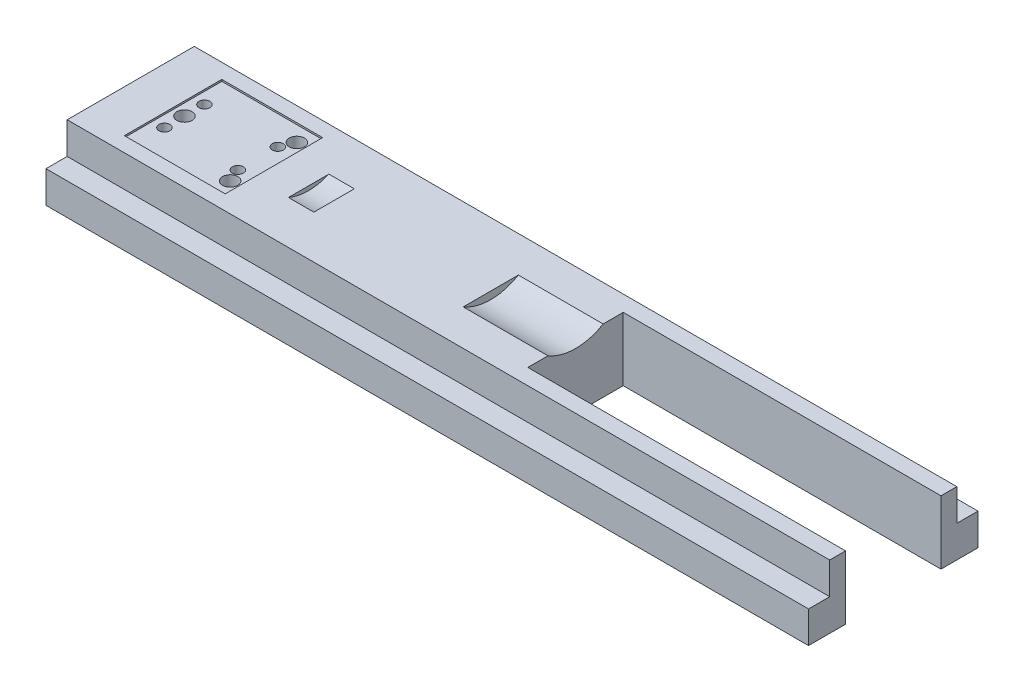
ISO-10303-21;
HEADER;
FILE_DESCRIPTION(('STEP AP214'),'2;1');
FILE_NAME('part.step','',(''),(''),'','','');
FILE_SCHEMA(('AUTOMOTIVE_DESIGN { 1 0 10303 214 1 1 1 1 }'));
ENDSEC;
DATA;
#1=APPLICATION_CONTEXT('core data for automotive mechanical design processes');
#2=APPLICATION_PROTOCOL_DEFINITION('international standard','automotive_design',2000,#1);
#3=PRODUCT_CONTEXT('',#1,'mechanical');
#4=PRODUCT('Part','Part','',(#3));
#5=PRODUCT_RELATED_PRODUCT_CATEGORY('part','',(#4));
#6=PRODUCT_DEFINITION_FORMATION('','',#4);
#7=PRODUCT_DEFINITION_CONTEXT('part definition',#1,'design');
#8=PRODUCT_DEFINITION('design','',#6,#7);
#9=PRODUCT_DEFINITION_SHAPE('','',#8);
#10=(LENGTH_UNIT() NAMED_UNIT(*) SI_UNIT(.MILLI.,.METRE.));
#11=(NAMED_UNIT(*) PLANE_ANGLE_UNIT() SI_UNIT($,.RADIAN.));
#12=(NAMED_UNIT(*) SI_UNIT($,.STERADIAN.) SOLID_ANGLE_UNIT());
#13=UNCERTAINTY_MEASURE_WITH_UNIT(LENGTH_MEASURE(1.E-05),#10,'distance_accuracy_value','');
#14=(GEOMETRIC_REPRESENTATION_CONTEXT(3) GLOBAL_UNCERTAINTY_ASSIGNED_CONTEXT((#13)) GLOBAL_UNIT_ASSIGNED_CONTEXT((#10,
#11,#12)) REPRESENTATION_CONTEXT('',''));
#15=CARTESIAN_POINT('',(0.,0.,0.));
#16=DIRECTION('',(0.,0.,1.));
#17=DIRECTION('',(1.,0.,0.));
#18=AXIS2_PLACEMENT_3D('',#15,#16,#17);
#19=CARTESIAN_POINT('',(0.,0.,0.));
#20=DIRECTION('',(0.,1.,0.));
#21=DIRECTION('',(0.,0.,1.));
#22=AXIS2_PLACEMENT_3D('',#19,#20,#21);
#23=PLANE('',#22);
#24=DIRECTION('',(1.,0.,0.));
#25=VECTOR('',#24,1.);
#26=CARTESIAN_POINT('',(133.35,0.,39.7002));
#27=LINE('',#26,#25);
#28=CARTESIAN_POINT('',(133.35,0.,39.7002));
#29=VERTEX_POINT('',#28);
#30=CARTESIAN_POINT('',(228.6,0.,39.7002));
#31=VERTEX_POINT('',#30);
#32=EDGE_CURVE('E273',#29,#31,#27,.T.);
#33=ORIENTED_EDGE('',*,*,#32,.F.);
#34=DIRECTION('',(0.,0.,1.));
#35=VECTOR('',#34,1.);
#36=CARTESIAN_POINT('',(133.35,0.,39.7002));
#37=LINE('',#36,#35);
#38=CARTESIAN_POINT('',(133.35,0.,33.6696018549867));
#39=VERTEX_POINT('',#38);
#40=EDGE_CURVE('E267',#39,#29,#37,.T.);
#41=ORIENTED_EDGE('',*,*,#40,.F.);
#42=DIRECTION('',(1.,0.,0.));
#43=VECTOR('',#42,1.);
#44=CARTESIAN_POINT('',(107.95,0.,33.6696018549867));
#45=LINE('',#44,#43);
#46=CARTESIAN_POINT('',(107.95,0.,33.6696018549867));
#47=VERTEX_POINT('',#46);
#48=EDGE_CURVE('E409',#47,#39,#45,.T.);
#49=ORIENTED_EDGE('',*,*,#48,.F.);
#50=DIRECTION('',(0.,0.,-1.));
#51=VECTOR('',#50,1.);
#52=CARTESIAN_POINT('',(107.95,0.,0.));
#53=LINE('',#52,#51);
#54=CARTESIAN_POINT('',(107.95,0.,17.1303981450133));
#55=VERTEX_POINT('',#54);
#56=EDGE_CURVE('E412',#47,#55,#53,.T.);
#57=ORIENTED_EDGE('',*,*,#56,.T.);
#58=DIRECTION('',(1.,0.,0.));
#59=VECTOR('',#58,1.);
#60=CARTESIAN_POINT('',(107.95,0.,17.1303981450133));
#61=LINE('',#60,#59);
#62=CARTESIAN_POINT('',(133.35,0.,17.1303981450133));
#63=VERTEX_POINT('',#62);
#64=EDGE_CURVE('E399',#63,#55,#61,.F.);
#65=ORIENTED_EDGE('',*,*,#64,.F.);
#66=CARTESIAN_POINT('',(133.35,0.,11.0998));
#67=VERTEX_POINT('',#66);
#68=EDGE_CURVE('E268',#67,#63,#37,.T.);
#69=ORIENTED_EDGE('',*,*,#68,.F.);
#70=DIRECTION('',(1.,0.,0.));
#71=VECTOR('',#70,1.);
#72=CARTESIAN_POINT('',(133.35,0.,11.0998));
#73=LINE('',#72,#71);
#74=CARTESIAN_POINT('',(228.6,0.,11.0998));
#75=VERTEX_POINT('',#74);
#76=EDGE_CURVE('E276',#67,#75,#73,.T.);
#77=ORIENTED_EDGE('',*,*,#76,.T.);
#78=DIRECTION('',(0.,0.,-1.));
#79=VECTOR('',#78,1.);
#80=CARTESIAN_POINT('',(228.6,0.,0.));
#81=LINE('',#80,#79);
#82=CARTESIAN_POINT('',(228.6,0.,6.35));
#83=VERTEX_POINT('',#82);
#84=EDGE_CURVE('E393',#75,#83,#81,.T.);
#85=ORIENTED_EDGE('',*,*,#84,.T.);
#86=DIRECTION('',(1.,0.,0.));
#87=VECTOR('',#86,1.);
#88=CARTESIAN_POINT('',(0.,0.,6.35));
#89=LINE('',#88,#87);
#90=CARTESIAN_POINT('',(0.,0.,6.35));
#91=VERTEX_POINT('',#90);
#92=EDGE_CURVE('E310',#91,#83,#89,.T.);
#93=ORIENTED_EDGE('',*,*,#92,.F.);
#94=DIRECTION('',(0.,0.,1.));
#95=VECTOR('',#94,1.);
#96=CARTESIAN_POINT('',(0.,0.,0.));
#97=LINE('',#96,#95);
#98=CARTESIAN_POINT('',(0.,0.,44.45));
#99=VERTEX_POINT('',#98);
#100=EDGE_CURVE('E369',#91,#99,#97,.T.);
#101=ORIENTED_EDGE('',*,*,#100,.T.);
#102=DIRECTION('',(1.,0.,0.));
#103=VECTOR('',#102,1.);
#104=CARTESIAN_POINT('',(0.,0.,44.45));
#105=LINE('',#104,#103);
#106=CARTESIAN_POINT('',(228.6,0.,44.45));
#107=VERTEX_POINT('',#106);
#108=EDGE_CURVE('E296',#99,#107,#105,.T.);
#109=ORIENTED_EDGE('',*,*,#108,.T.);
#110=EDGE_CURVE('E380',#107,#31,#81,.T.);
#111=ORIENTED_EDGE('',*,*,#110,.T.);
#112=EDGE_LOOP('',(#33,#41,#49,#57,#65,#69,#77,#85,#93,#101,#109,#111));
#113=FACE_BOUND('',#112,.T.);
#114=DIRECTION('',(0.,0.,1.));
#115=VECTOR('',#114,1.);
#116=CARTESIAN_POINT('',(12.7,0.,40.005));
#117=LINE('',#116,#115);
#118=CARTESIAN_POINT('',(12.7,0.,10.795));
#119=VERTEX_POINT('',#118);
#120=CARTESIAN_POINT('',(12.7,0.,40.005));
#121=VERTEX_POINT('',#120);
#122=EDGE_CURVE('E343',#119,#121,#117,.T.);
#123=ORIENTED_EDGE('',*,*,#122,.F.);
#124=DIRECTION('',(-1.,0.,0.));
#125=VECTOR('',#124,1.);
#126=CARTESIAN_POINT('',(12.7,0.,10.795));
#127=LINE('',#126,#125);
#128=CARTESIAN_POINT('',(42.926,0.,10.795));
#129=VERTEX_POINT('',#128);
#130=EDGE_CURVE('E348',#129,#119,#127,.T.);
#131=ORIENTED_EDGE('',*,*,#130,.F.);
#132=DIRECTION('',(0.,0.,-1.));
#133=VECTOR('',#132,1.);
#134=CARTESIAN_POINT('',(42.926,0.,40.005));
#135=LINE('',#134,#133);
#136=CARTESIAN_POINT('',(42.926,0.,40.005));
#137=VERTEX_POINT('',#136);
#138=EDGE_CURVE('E362',#137,#129,#135,.T.);
#139=ORIENTED_EDGE('',*,*,#138,.F.);
#140=DIRECTION('',(1.,0.,0.));
#141=VECTOR('',#140,1.);
#142=CARTESIAN_POINT('',(12.7,0.,40.005));
#143=LINE('',#142,#141);
#144=EDGE_CURVE('E359',#121,#137,#143,.T.);
#145=ORIENTED_EDGE('',*,*,#144,.F.);
#146=EDGE_LOOP('',(#123,#131,#139,#145));
#147=FACE_BOUND('',#146,.T.);
#148=DIRECTION('',(1.,0.,0.));
#149=VECTOR('',#148,1.);
#150=CARTESIAN_POINT('',(53.34,0.,31.4641269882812));
#151=LINE('',#150,#149);
#152=CARTESIAN_POINT('',(53.34,0.,31.4641269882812));
#153=VERTEX_POINT('',#152);
#154=CARTESIAN_POINT('',(60.96,0.,31.4641269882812));
#155=VERTEX_POINT('',#154);
#156=EDGE_CURVE('E42',#153,#155,#151,.T.);
#157=ORIENTED_EDGE('',*,*,#156,.F.);
#158=DIRECTION('',(0.,0.,-1.));
#159=VECTOR('',#158,1.);
#160=CARTESIAN_POINT('',(53.34,0.,0.));
#161=LINE('',#160,#159);
#162=CARTESIAN_POINT('',(53.34,0.,19.3358730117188));
#163=VERTEX_POINT('',#162);
#164=EDGE_CURVE('E11',#153,#163,#161,.T.);
#165=ORIENTED_EDGE('',*,*,#164,.T.);
#166=DIRECTION('',(1.,0.,0.));
#167=VECTOR('',#166,1.);
#168=CARTESIAN_POINT('',(53.34,0.,19.3358730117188));
#169=LINE('',#168,#167);
#170=CARTESIAN_POINT('',(60.96,0.,19.3358730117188));
#171=VERTEX_POINT('',#170);
#172=EDGE_CURVE('E419',#171,#163,#169,.F.);
#173=ORIENTED_EDGE('',*,*,#172,.F.);
#174=DIRECTION('',(0.,0.,-1.));
#175=VECTOR('',#174,1.);
#176=CARTESIAN_POINT('',(60.96,0.,0.));
#177=LINE('',#176,#175);
#178=EDGE_CURVE('E417',#155,#171,#177,.T.);
#179=ORIENTED_EDGE('',*,*,#178,.F.);
#180=EDGE_LOOP('',(#157,#165,#173,#179));
#181=FACE_BOUND('',#180,.T.);
#182=ADVANCED_FACE('F33',(#113,#147,#181),#23,.T.);
#183=CARTESIAN_POINT('',(228.6,-19.05,0.));
#184=DIRECTION('',(1.,0.,0.));
#185=DIRECTION('',(0.,0.,-1.));
#186=AXIS2_PLACEMENT_3D('',#183,#184,#185);
#187=PLANE('',#186);
#188=DIRECTION('',(0.,-1.,0.));
#189=VECTOR('',#188,1.);
#190=CARTESIAN_POINT('',(228.6,0.,39.7002));
#191=LINE('',#190,#189);
#192=CARTESIAN_POINT('',(228.6,-19.05,39.7002));
#193=VERTEX_POINT('',#192);
#194=EDGE_CURVE('E255',#31,#193,#191,.T.);
#195=ORIENTED_EDGE('',*,*,#194,.F.);
#196=ORIENTED_EDGE('',*,*,#110,.F.);
#197=DIRECTION('',(0.,1.,0.));
#198=VECTOR('',#197,1.);
#199=CARTESIAN_POINT('',(228.6,0.,44.45));
#200=LINE('',#199,#198);
#201=CARTESIAN_POINT('',(228.6,-9.525,44.45));
#202=VERTEX_POINT('',#201);
#203=EDGE_CURVE('E287',#202,#107,#200,.T.);
#204=ORIENTED_EDGE('',*,*,#203,.F.);
#205=DIRECTION('',(0.,0.,-1.));
#206=VECTOR('',#205,1.);
#207=CARTESIAN_POINT('',(228.6,-9.525,50.8));
#208=LINE('',#207,#206);
#209=CARTESIAN_POINT('',(228.6,-9.525,50.8));
#210=VERTEX_POINT('',#209);
#211=EDGE_CURVE('E291',#210,#202,#208,.T.);
#212=ORIENTED_EDGE('',*,*,#211,.F.);
#213=DIRECTION('',(0.,1.,0.));
#214=VECTOR('',#213,1.);
#215=CARTESIAN_POINT('',(228.6,-19.05,50.8));
#216=LINE('',#215,#214);
#217=CARTESIAN_POINT('',(228.6,-19.05,50.8));
#218=VERTEX_POINT('',#217);
#219=EDGE_CURVE('E403',#218,#210,#216,.T.);
#220=ORIENTED_EDGE('',*,*,#219,.F.);
#221=DIRECTION('',(0.,0.,-1.));
#222=VECTOR('',#221,1.);
#223=CARTESIAN_POINT('',(228.6,-19.05,0.));
#224=LINE('',#223,#222);
#225=EDGE_CURVE('E384',#218,#193,#224,.T.);
#226=ORIENTED_EDGE('',*,*,#225,.T.);
#227=EDGE_LOOP('',(#195,#196,#204,#212,#220,#226));
#228=FACE_BOUND('',#227,.T.);
#229=ADVANCED_FACE('F442',(#228),#187,.T.);
#230=CARTESIAN_POINT('',(107.95,13.9954,25.4));
#231=DIRECTION('',(1.,0.,0.));
#232=DIRECTION('',(0.,0.,-1.));
#233=AXIS2_PLACEMENT_3D('',#230,#231,#232);
#234=CYLINDRICAL_SURFACE('',#233,16.256);
#235=CARTESIAN_POINT('',(133.35,13.9954,25.4));
#236=DIRECTION('',(1.,0.,0.));
#237=DIRECTION('',(0.,0.,-1.));
#238=AXIS2_PLACEMENT_3D('',#235,#236,#237);
#239=CIRCLE('',#238,16.256);
#240=EDGE_CURVE('E415',#63,#39,#239,.F.);
#241=ORIENTED_EDGE('',*,*,#240,.F.);
#242=ORIENTED_EDGE('',*,*,#64,.T.);
#243=CARTESIAN_POINT('',(107.95,13.9954,25.4));
#244=DIRECTION('',(1.,0.,0.));
#245=DIRECTION('',(0.,0.,-1.));
#246=AXIS2_PLACEMENT_3D('',#243,#244,#245);
#247=CIRCLE('',#246,16.256);
#248=EDGE_CURVE('E299',#47,#55,#247,.T.);
#249=ORIENTED_EDGE('',*,*,#248,.F.);
#250=ORIENTED_EDGE('',*,*,#48,.T.);
#251=EDGE_LOOP('',(#241,#242,#249,#250));
#252=FACE_BOUND('',#251,.T.);
#253=ADVANCED_FACE('F448',(#252),#234,.F.);
#254=CARTESIAN_POINT('',(0.,-19.05,0.));
#255=DIRECTION('',(-1.,0.,0.));
#256=DIRECTION('',(0.,0.,1.));
#257=AXIS2_PLACEMENT_3D('',#254,#255,#256);
#258=PLANE('',#257);
#259=DIRECTION('',(0.,1.,0.));
#260=VECTOR('',#259,1.);
#261=CARTESIAN_POINT('',(0.,0.,44.45));
#262=LINE('',#261,#260);
#263=CARTESIAN_POINT('',(0.,-9.525,44.45));
#264=VERTEX_POINT('',#263);
#265=EDGE_CURVE('E286',#264,#99,#262,.T.);
#266=ORIENTED_EDGE('',*,*,#265,.T.);
#267=ORIENTED_EDGE('',*,*,#100,.F.);
#268=DIRECTION('',(0.,-1.,0.));
#269=VECTOR('',#268,1.);
#270=CARTESIAN_POINT('',(0.,0.,6.35));
#271=LINE('',#270,#269);
#272=CARTESIAN_POINT('',(0.,-9.525,6.35));
#273=VERTEX_POINT('',#272);
#274=EDGE_CURVE('E303',#91,#273,#271,.T.);
#275=ORIENTED_EDGE('',*,*,#274,.T.);
#276=DIRECTION('',(0.,0.,-1.));
#277=VECTOR('',#276,1.);
#278=CARTESIAN_POINT('',(0.,-9.525,0.));
#279=LINE('',#278,#277);
#280=CARTESIAN_POINT('',(0.,-9.525,0.));
#281=VERTEX_POINT('',#280);
#282=EDGE_CURVE('E306',#273,#281,#279,.T.);
#283=ORIENTED_EDGE('',*,*,#282,.T.);
#284=DIRECTION('',(0.,1.,0.));
#285=VECTOR('',#284,1.);
#286=CARTESIAN_POINT('',(0.,-19.05,0.));
#287=LINE('',#286,#285);
#288=CARTESIAN_POINT('',(0.,-19.05,0.));
#289=VERTEX_POINT('',#288);
#290=EDGE_CURVE('E396',#289,#281,#287,.T.);
#291=ORIENTED_EDGE('',*,*,#290,.F.);
#292=DIRECTION('',(0.,0.,1.));
#293=VECTOR('',#292,1.);
#294=CARTESIAN_POINT('',(0.,-19.05,0.));
#295=LINE('',#294,#293);
#296=CARTESIAN_POINT('',(0.,-19.05,50.8));
#297=VERTEX_POINT('',#296);
#298=EDGE_CURVE('E376',#289,#297,#295,.T.);
#299=ORIENTED_EDGE('',*,*,#298,.T.);
#300=DIRECTION('',(0.,1.,0.));
#301=VECTOR('',#300,1.);
#302=CARTESIAN_POINT('',(0.,-19.05,50.8));
#303=LINE('',#302,#301);
#304=CARTESIAN_POINT('',(0.,-9.525,50.8));
#305=VERTEX_POINT('',#304);
#306=EDGE_CURVE('E390',#297,#305,#303,.T.);
#307=ORIENTED_EDGE('',*,*,#306,.T.);
#308=DIRECTION('',(0.,0.,-1.));
#309=VECTOR('',#308,1.);
#310=CARTESIAN_POINT('',(0.,-9.525,50.8));
#311=LINE('',#310,#309);
#312=EDGE_CURVE('E283',#305,#264,#311,.T.);
#313=ORIENTED_EDGE('',*,*,#312,.T.);
#314=EDGE_LOOP('',(#266,#267,#275,#283,#291,#299,#307,#313));
#315=FACE_BOUND('',#314,.T.);
#316=ADVANCED_FACE('F35',(#315),#258,.T.);
#317=CARTESIAN_POINT('',(0.,-19.05,0.));
#318=DIRECTION('',(0.,0.,-1.));
#319=DIRECTION('',(-1.,0.,0.));
#320=AXIS2_PLACEMENT_3D('',#317,#318,#319);
#321=PLANE('',#320);
#322=DIRECTION('',(1.,0.,0.));
#323=VECTOR('',#322,1.);
#324=CARTESIAN_POINT('',(0.,-9.525,0.));
#325=LINE('',#324,#323);
#326=CARTESIAN_POINT('',(228.6,-9.525,0.));
#327=VERTEX_POINT('',#326);
#328=EDGE_CURVE('E294',#281,#327,#325,.T.);
#329=ORIENTED_EDGE('',*,*,#328,.T.);
#330=DIRECTION('',(0.,1.,0.));
#331=VECTOR('',#330,1.);
#332=CARTESIAN_POINT('',(228.6,-19.05,0.));
#333=LINE('',#332,#331);
#334=CARTESIAN_POINT('',(228.6,-19.05,0.));
#335=VERTEX_POINT('',#334);
#336=EDGE_CURVE('E400',#335,#327,#333,.T.);
#337=ORIENTED_EDGE('',*,*,#336,.F.);
#338=DIRECTION('',(-1.,0.,0.));
#339=VECTOR('',#338,1.);
#340=CARTESIAN_POINT('',(0.,-19.05,0.));
#341=LINE('',#340,#339);
#342=EDGE_CURVE('E387',#335,#289,#341,.T.);
#343=ORIENTED_EDGE('',*,*,#342,.T.);
#344=ORIENTED_EDGE('',*,*,#290,.T.);
#345=EDGE_LOOP('',(#329,#337,#343,#344));
#346=FACE_BOUND('',#345,.T.);
#347=ADVANCED_FACE('F458',(#346),#321,.T.);
#348=DIRECTION('',(0.,1.,0.));
#349=VECTOR('',#348,1.);
#350=CARTESIAN_POINT('',(228.6,0.,11.0998));
#351=LINE('',#350,#349);
#352=CARTESIAN_POINT('',(228.6,-19.05,11.0998));
#353=VERTEX_POINT('',#352);
#354=EDGE_CURVE('E261',#353,#75,#351,.T.);
#355=ORIENTED_EDGE('',*,*,#354,.F.);
#356=EDGE_CURVE('E383',#353,#335,#224,.T.);
#357=ORIENTED_EDGE('',*,*,#356,.T.);
#358=ORIENTED_EDGE('',*,*,#336,.T.);
#359=DIRECTION('',(0.,0.,-1.));
#360=VECTOR('',#359,1.);
#361=CARTESIAN_POINT('',(228.6,-9.525,0.));
#362=LINE('',#361,#360);
#363=CARTESIAN_POINT('',(228.6,-9.525,6.35));
#364=VERTEX_POINT('',#363);
#365=EDGE_CURVE('E307',#364,#327,#362,.T.);
#366=ORIENTED_EDGE('',*,*,#365,.F.);
#367=DIRECTION('',(0.,-1.,0.));
#368=VECTOR('',#367,1.);
#369=CARTESIAN_POINT('',(228.6,0.,6.35));
#370=LINE('',#369,#368);
#371=EDGE_CURVE('E275',#83,#364,#370,.T.);
#372=ORIENTED_EDGE('',*,*,#371,.F.);
#373=ORIENTED_EDGE('',*,*,#84,.F.);
#374=EDGE_LOOP('',(#355,#357,#358,#366,#372,#373));
#375=FACE_BOUND('',#374,.T.);
#376=ADVANCED_FACE('F451',(#375),#187,.T.);
#377=CARTESIAN_POINT('',(0.,-19.05,50.8));
#378=DIRECTION('',(0.,0.,1.));
#379=DIRECTION('',(1.,0.,0.));
#380=AXIS2_PLACEMENT_3D('',#377,#378,#379);
#381=PLANE('',#380);
#382=DIRECTION('',(1.,0.,0.));
#383=VECTOR('',#382,1.);
#384=CARTESIAN_POINT('',(0.,-9.525,50.8));
#385=LINE('',#384,#383);
#386=EDGE_CURVE('E290',#305,#210,#385,.T.);
#387=ORIENTED_EDGE('',*,*,#386,.F.);
#388=ORIENTED_EDGE('',*,*,#306,.F.);
#389=DIRECTION('',(1.,0.,0.));
#390=VECTOR('',#389,1.);
#391=CARTESIAN_POINT('',(0.,-19.05,50.8));
#392=LINE('',#391,#390);
#393=EDGE_CURVE('E379',#297,#218,#392,.T.);
#394=ORIENTED_EDGE('',*,*,#393,.T.);
#395=ORIENTED_EDGE('',*,*,#219,.T.);
#396=EDGE_LOOP('',(#387,#388,#394,#395));
#397=FACE_BOUND('',#396,.T.);
#398=ADVANCED_FACE('F462',(#397),#381,.T.);
#399=CARTESIAN_POINT('',(0.,-19.05,0.));
#400=DIRECTION('',(0.,1.,0.));
#401=DIRECTION('',(0.,0.,1.));
#402=AXIS2_PLACEMENT_3D('',#399,#400,#401);
#403=PLANE('',#402);
#404=DIRECTION('',(1.,0.,0.));
#405=VECTOR('',#404,1.);
#406=CARTESIAN_POINT('',(7.9248,-19.05,7.9248));
#407=LINE('',#406,#405);
#408=CARTESIAN_POINT('',(7.9248,-19.05,7.9248));
#409=VERTEX_POINT('',#408);
#410=CARTESIAN_POINT('',(47.625,-19.05,7.9248));
#411=VERTEX_POINT('',#410);
#412=EDGE_CURVE('E225',#409,#411,#407,.T.);
#413=ORIENTED_EDGE('',*,*,#412,.F.);
#414=DIRECTION('',(0.,0.,-1.));
#415=VECTOR('',#414,1.);
#416=CARTESIAN_POINT('',(7.9248,-19.05,7.9248));
#417=LINE('',#416,#415);
#418=CARTESIAN_POINT('',(7.9248,-19.05,42.8752));
#419=VERTEX_POINT('',#418);
#420=EDGE_CURVE('E49',#419,#409,#417,.T.);
#421=ORIENTED_EDGE('',*,*,#420,.F.);
#422=DIRECTION('',(-1.,0.,0.));
#423=VECTOR('',#422,1.);
#424=CARTESIAN_POINT('',(7.9248,-19.05,42.8752));
#425=LINE('',#424,#423);
#426=CARTESIAN_POINT('',(47.625,-19.05,42.8752));
#427=VERTEX_POINT('',#426);
#428=EDGE_CURVE('E216',#427,#419,#425,.T.);
#429=ORIENTED_EDGE('',*,*,#428,.F.);
#430=DIRECTION('',(0.,0.,1.));
#431=VECTOR('',#430,1.);
#432=CARTESIAN_POINT('',(47.625,-19.05,7.9248));
#433=LINE('',#432,#431);
#434=EDGE_CURVE('E219',#411,#427,#433,.T.);
#435=ORIENTED_EDGE('',*,*,#434,.F.);
#436=EDGE_LOOP('',(#413,#421,#429,#435));
#437=FACE_BOUND('',#436,.T.);
#438=DIRECTION('',(0.,0.,-1.));
#439=VECTOR('',#438,1.);
#440=CARTESIAN_POINT('',(133.35,-19.05,39.7002));
#441=LINE('',#440,#439);
#442=CARTESIAN_POINT('',(133.35,-19.05,39.7002));
#443=VERTEX_POINT('',#442);
#444=CARTESIAN_POINT('',(133.35,-19.05,11.0998));
#445=VERTEX_POINT('',#444);
#446=EDGE_CURVE('E260',#443,#445,#441,.T.);
#447=ORIENTED_EDGE('',*,*,#446,.F.);
#448=DIRECTION('',(1.,0.,0.));
#449=VECTOR('',#448,1.);
#450=CARTESIAN_POINT('',(133.35,-19.05,39.7002));
#451=LINE('',#450,#449);
#452=EDGE_CURVE('E270',#443,#193,#451,.T.);
#453=ORIENTED_EDGE('',*,*,#452,.T.);
#454=ORIENTED_EDGE('',*,*,#225,.F.);
#455=ORIENTED_EDGE('',*,*,#393,.F.);
#456=ORIENTED_EDGE('',*,*,#298,.F.);
#457=ORIENTED_EDGE('',*,*,#342,.F.);
#458=ORIENTED_EDGE('',*,*,#356,.F.);
#459=DIRECTION('',(1.,0.,0.));
#460=VECTOR('',#459,1.);
#461=CARTESIAN_POINT('',(133.35,-19.05,11.0998));
#462=LINE('',#461,#460);
#463=EDGE_CURVE('E279',#445,#353,#462,.T.);
#464=ORIENTED_EDGE('',*,*,#463,.F.);
#465=EDGE_LOOP('',(#447,#453,#454,#455,#456,#457,#458,#464));
#466=FACE_BOUND('',#465,.T.);
#467=ADVANCED_FACE('F456',(#437,#466),#403,.F.);
#468=CARTESIAN_POINT('',(12.7,-0.508,40.005));
#469=DIRECTION('',(-1.,0.,0.));
#470=DIRECTION('',(0.,0.,1.));
#471=AXIS2_PLACEMENT_3D('',#468,#469,#470);
#472=PLANE('',#471);
#473=ORIENTED_EDGE('',*,*,#122,.T.);
#474=DIRECTION('',(0.,1.,0.));
#475=VECTOR('',#474,1.);
#476=CARTESIAN_POINT('',(12.7,-0.508,40.005));
#477=LINE('',#476,#475);
#478=CARTESIAN_POINT('',(12.7,-0.508,40.005));
#479=VERTEX_POINT('',#478);
#480=EDGE_CURVE('E357',#479,#121,#477,.T.);
#481=ORIENTED_EDGE('',*,*,#480,.F.);
#482=DIRECTION('',(0.,0.,1.));
#483=VECTOR('',#482,1.);
#484=CARTESIAN_POINT('',(12.7,-0.508,40.005));
#485=LINE('',#484,#483);
#486=CARTESIAN_POINT('',(12.7,-0.508,10.795));
#487=VERTEX_POINT('',#486);
#488=EDGE_CURVE('E344',#487,#479,#485,.T.);
#489=ORIENTED_EDGE('',*,*,#488,.F.);
#490=DIRECTION('',(0.,1.,0.));
#491=VECTOR('',#490,1.);
#492=CARTESIAN_POINT('',(12.7,-0.508,10.795));
#493=LINE('',#492,#491);
#494=EDGE_CURVE('E367',#487,#119,#493,.T.);
#495=ORIENTED_EDGE('',*,*,#494,.T.);
#496=EDGE_LOOP('',(#473,#481,#489,#495));
#497=FACE_BOUND('',#496,.T.);
#498=ADVANCED_FACE('F469',(#497),#472,.F.);
#499=CARTESIAN_POINT('',(12.7,-0.508,10.795));
#500=DIRECTION('',(0.,0.,-1.));
#501=DIRECTION('',(-1.,0.,0.));
#502=AXIS2_PLACEMENT_3D('',#499,#500,#501);
#503=PLANE('',#502);
#504=ORIENTED_EDGE('',*,*,#130,.T.);
#505=ORIENTED_EDGE('',*,*,#494,.F.);
#506=DIRECTION('',(-1.,0.,0.));
#507=VECTOR('',#506,1.);
#508=CARTESIAN_POINT('',(12.7,-0.508,10.795));
#509=LINE('',#508,#507);
#510=CARTESIAN_POINT('',(42.926,-0.508,10.795));
#511=VERTEX_POINT('',#510);
#512=EDGE_CURVE('E354',#511,#487,#509,.T.);
#513=ORIENTED_EDGE('',*,*,#512,.F.);
#514=DIRECTION('',(0.,1.,0.));
#515=VECTOR('',#514,1.);
#516=CARTESIAN_POINT('',(42.926,-0.508,10.795));
#517=LINE('',#516,#515);
#518=EDGE_CURVE('E370',#511,#129,#517,.T.);
#519=ORIENTED_EDGE('',*,*,#518,.T.);
#520=EDGE_LOOP('',(#504,#505,#513,#519));
#521=FACE_BOUND('',#520,.T.);
#522=ADVANCED_FACE('F562',(#521),#503,.F.);
#523=CARTESIAN_POINT('',(42.926,-0.508,40.005));
#524=DIRECTION('',(1.,0.,0.));
#525=DIRECTION('',(0.,0.,-1.));
#526=AXIS2_PLACEMENT_3D('',#523,#524,#525);
#527=PLANE('',#526);
#528=ORIENTED_EDGE('',*,*,#138,.T.);
#529=ORIENTED_EDGE('',*,*,#518,.F.);
#530=DIRECTION('',(0.,0.,-1.));
#531=VECTOR('',#530,1.);
#532=CARTESIAN_POINT('',(42.926,-0.508,40.005));
#533=LINE('',#532,#531);
#534=CARTESIAN_POINT('',(42.926,-0.508,40.005));
#535=VERTEX_POINT('',#534);
#536=EDGE_CURVE('E351',#535,#511,#533,.T.);
#537=ORIENTED_EDGE('',*,*,#536,.F.);
#538=DIRECTION('',(0.,1.,0.));
#539=VECTOR('',#538,1.);
#540=CARTESIAN_POINT('',(42.926,-0.508,40.005));
#541=LINE('',#540,#539);
#542=EDGE_CURVE('E372',#535,#137,#541,.T.);
#543=ORIENTED_EDGE('',*,*,#542,.T.);
#544=EDGE_LOOP('',(#528,#529,#537,#543));
#545=FACE_BOUND('',#544,.T.);
#546=ADVANCED_FACE('F565',(#545),#527,.F.);
#547=CARTESIAN_POINT('',(12.7,-0.508,40.005));
#548=DIRECTION('',(0.,0.,1.));
#549=DIRECTION('',(1.,0.,0.));
#550=AXIS2_PLACEMENT_3D('',#547,#548,#549);
#551=PLANE('',#550);
#552=ORIENTED_EDGE('',*,*,#144,.T.);
#553=ORIENTED_EDGE('',*,*,#542,.F.);
#554=DIRECTION('',(1.,0.,0.));
#555=VECTOR('',#554,1.);
#556=CARTESIAN_POINT('',(12.7,-0.508,40.005));
#557=LINE('',#556,#555);
#558=EDGE_CURVE('E347',#479,#535,#557,.T.);
#559=ORIENTED_EDGE('',*,*,#558,.F.);
#560=ORIENTED_EDGE('',*,*,#480,.T.);
#561=EDGE_LOOP('',(#552,#553,#559,#560));
#562=FACE_BOUND('',#561,.T.);
#563=ADVANCED_FACE('F560',(#562),#551,.F.);
#564=CARTESIAN_POINT('',(0.,-0.508,0.));
#565=DIRECTION('',(0.,-1.,0.));
#566=DIRECTION('',(0.,0.,-1.));
#567=AXIS2_PLACEMENT_3D('',#564,#565,#566);
#568=PLANE('',#567);
#569=CARTESIAN_POINT('',(16.1036,-0.508,19.4056));
#570=DIRECTION('',(0.,1.,0.));
#571=DIRECTION('',(0.,0.,1.));
#572=AXIS2_PLACEMENT_3D('',#569,#570,#571);
#573=CIRCLE('',#572,1.651);
#574=CARTESIAN_POINT('',(16.1036,-0.508,21.0566));
#575=VERTEX_POINT('',#574);
#576=EDGE_CURVE('E329',#575,#575,#573,.T.);
#577=ORIENTED_EDGE('',*,*,#576,.F.);
#578=EDGE_LOOP('',(#577));
#579=FACE_BOUND('',#578,.T.);
#580=CARTESIAN_POINT('',(16.1036,-0.508,31.3944));
#581=DIRECTION('',(0.,1.,0.));
#582=DIRECTION('',(0.,0.,1.));
#583=AXIS2_PLACEMENT_3D('',#580,#581,#582);
#584=CIRCLE('',#583,1.651);
#585=CARTESIAN_POINT('',(16.1036,-0.508,33.0454));
#586=VERTEX_POINT('',#585);
#587=EDGE_CURVE('E333',#586,#586,#584,.T.);
#588=ORIENTED_EDGE('',*,*,#587,.F.);
#589=EDGE_LOOP('',(#588));
#590=FACE_BOUND('',#589,.T.);
#591=CARTESIAN_POINT('',(39.8018,-0.508,15.4051));
#592=DIRECTION('',(0.,1.,0.));
#593=DIRECTION('',(0.,0.,1.));
#594=AXIS2_PLACEMENT_3D('',#591,#592,#593);
#595=CIRCLE('',#594,2.286);
#596=CARTESIAN_POINT('',(39.8018,-0.508,17.6911));
#597=VERTEX_POINT('',#596);
#598=EDGE_CURVE('E336',#597,#597,#595,.T.);
#599=ORIENTED_EDGE('',*,*,#598,.F.);
#600=EDGE_LOOP('',(#599));
#601=FACE_BOUND('',#600,.T.);
#602=CARTESIAN_POINT('',(39.8018,-0.508,35.3949));
#603=DIRECTION('',(0.,1.,0.));
#604=DIRECTION('',(0.,0.,1.));
#605=AXIS2_PLACEMENT_3D('',#602,#603,#604);
#606=CIRCLE('',#605,2.28599999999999);
#607=CARTESIAN_POINT('',(39.8018,-0.508,37.6809));
#608=VERTEX_POINT('',#607);
#609=EDGE_CURVE('E326',#608,#608,#606,.T.);
#610=ORIENTED_EDGE('',*,*,#609,.F.);
#611=EDGE_LOOP('',(#610));
#612=FACE_BOUND('',#611,.T.);
#613=CARTESIAN_POINT('',(38.1,-0.508,19.4056));
#614=DIRECTION('',(0.,1.,0.));
#615=DIRECTION('',(0.,0.,1.));
#616=AXIS2_PLACEMENT_3D('',#613,#614,#615);
#617=CIRCLE('',#616,1.651);
#618=CARTESIAN_POINT('',(38.1,-0.508,21.0566));
#619=VERTEX_POINT('',#618);
#620=EDGE_CURVE('E323',#619,#619,#617,.T.);
#621=ORIENTED_EDGE('',*,*,#620,.F.);
#622=EDGE_LOOP('',(#621));
#623=FACE_BOUND('',#622,.T.);
#624=CARTESIAN_POINT('',(38.1,-0.508,31.3944));
#625=DIRECTION('',(0.,1.,0.));
#626=DIRECTION('',(0.,0.,1.));
#627=AXIS2_PLACEMENT_3D('',#624,#625,#626);
#628=CIRCLE('',#627,1.651);
#629=CARTESIAN_POINT('',(38.1,-0.508,33.0454));
#630=VERTEX_POINT('',#629);
#631=EDGE_CURVE('E322',#630,#630,#628,.T.);
#632=ORIENTED_EDGE('',*,*,#631,.F.);
#633=EDGE_LOOP('',(#632));
#634=FACE_BOUND('',#633,.T.);
#635=CARTESIAN_POINT('',(16.1036,-0.508,25.4));
#636=DIRECTION('',(0.,1.,0.));
#637=DIRECTION('',(0.,0.,1.));
#638=AXIS2_PLACEMENT_3D('',#635,#636,#637);
#639=CIRCLE('',#638,2.286);
#640=CARTESIAN_POINT('',(16.1036,-0.508,27.686));
#641=VERTEX_POINT('',#640);
#642=EDGE_CURVE('E332',#641,#641,#639,.T.);
#643=ORIENTED_EDGE('',*,*,#642,.F.);
#644=EDGE_LOOP('',(#643));
#645=FACE_BOUND('',#644,.T.);
#646=ORIENTED_EDGE('',*,*,#488,.T.);
#647=ORIENTED_EDGE('',*,*,#558,.T.);
#648=ORIENTED_EDGE('',*,*,#536,.T.);
#649=ORIENTED_EDGE('',*,*,#512,.T.);
#650=EDGE_LOOP('',(#646,#647,#648,#649));
#651=FACE_BOUND('',#650,.T.);
#652=ADVANCED_FACE('F556',(#579,#590,#601,#612,#623,#634,#645,#651),#568,.F.);
#653=CARTESIAN_POINT('',(16.1036,-19.05,25.4));
#654=DIRECTION('',(0.,1.,0.));
#655=DIRECTION('',(0.,0.,1.));
#656=AXIS2_PLACEMENT_3D('',#653,#654,#655);
#657=CYLINDRICAL_SURFACE('',#656,2.286);
#658=CARTESIAN_POINT('',(16.1036,-15.0876,25.4));
#659=DIRECTION('',(0.,1.,0.));
#660=DIRECTION('',(0.,0.,1.));
#661=AXIS2_PLACEMENT_3D('',#658,#659,#660);
#662=CIRCLE('',#661,2.286);
#663=CARTESIAN_POINT('',(16.1036,-15.0876,27.686));
#664=VERTEX_POINT('',#663);
#665=EDGE_CURVE('E249',#664,#664,#662,.F.);
#666=ORIENTED_EDGE('',*,*,#665,.T.);
#667=EDGE_LOOP('',(#666));
#668=FACE_BOUND('',#667,.T.);
#669=ORIENTED_EDGE('',*,*,#642,.T.);
#670=EDGE_LOOP('',(#669));
#671=FACE_BOUND('',#670,.T.);
#672=ADVANCED_FACE('F538',(#668,#671),#657,.F.);
#673=CARTESIAN_POINT('',(38.1,-19.05,31.3944));
#674=DIRECTION('',(0.,1.,0.));
#675=DIRECTION('',(0.,0.,1.));
#676=AXIS2_PLACEMENT_3D('',#673,#674,#675);
#677=CYLINDRICAL_SURFACE('',#676,1.651);
#678=CARTESIAN_POINT('',(38.1,-15.0876,31.3944));
#679=DIRECTION('',(0.,1.,0.));
#680=DIRECTION('',(0.,0.,1.));
#681=AXIS2_PLACEMENT_3D('',#678,#679,#680);
#682=CIRCLE('',#681,1.651);
#683=CARTESIAN_POINT('',(38.1,-15.0876,33.0454));
#684=VERTEX_POINT('',#683);
#685=EDGE_CURVE('E246',#684,#684,#682,.F.);
#686=ORIENTED_EDGE('',*,*,#685,.T.);
#687=EDGE_LOOP('',(#686));
#688=FACE_BOUND('',#687,.T.);
#689=ORIENTED_EDGE('',*,*,#631,.T.);
#690=EDGE_LOOP('',(#689));
#691=FACE_BOUND('',#690,.T.);
#692=ADVANCED_FACE('F534',(#688,#691),#677,.F.);
#693=CARTESIAN_POINT('',(38.1,-19.05,19.4056));
#694=DIRECTION('',(0.,1.,0.));
#695=DIRECTION('',(0.,0.,1.));
#696=AXIS2_PLACEMENT_3D('',#693,#694,#695);
#697=CYLINDRICAL_SURFACE('',#696,1.651);
#698=CARTESIAN_POINT('',(38.1,-15.0876,19.4056));
#699=DIRECTION('',(0.,1.,0.));
#700=DIRECTION('',(0.,0.,1.));
#701=AXIS2_PLACEMENT_3D('',#698,#699,#700);
#702=CIRCLE('',#701,1.651);
#703=CARTESIAN_POINT('',(38.1,-15.0876,21.0566));
#704=VERTEX_POINT('',#703);
#705=EDGE_CURVE('E243',#704,#704,#702,.F.);
#706=ORIENTED_EDGE('',*,*,#705,.T.);
#707=EDGE_LOOP('',(#706));
#708=FACE_BOUND('',#707,.T.);
#709=ORIENTED_EDGE('',*,*,#620,.T.);
#710=EDGE_LOOP('',(#709));
#711=FACE_BOUND('',#710,.T.);
#712=ADVANCED_FACE('F530',(#708,#711),#697,.F.);
#713=CARTESIAN_POINT('',(39.8018,-19.05,35.3949));
#714=DIRECTION('',(0.,1.,0.));
#715=DIRECTION('',(0.,0.,1.));
#716=AXIS2_PLACEMENT_3D('',#713,#714,#715);
#717=CYLINDRICAL_SURFACE('',#716,2.28599999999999);
#718=CARTESIAN_POINT('',(39.8018,-15.0876,35.3949));
#719=DIRECTION('',(0.,1.,0.));
#720=DIRECTION('',(0.,0.,1.));
#721=AXIS2_PLACEMENT_3D('',#718,#719,#720);
#722=CIRCLE('',#721,2.28599999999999);
#723=CARTESIAN_POINT('',(39.8018,-15.0876,37.6809));
#724=VERTEX_POINT('',#723);
#725=EDGE_CURVE('E240',#724,#724,#722,.F.);
#726=ORIENTED_EDGE('',*,*,#725,.T.);
#727=EDGE_LOOP('',(#726));
#728=FACE_BOUND('',#727,.T.);
#729=ORIENTED_EDGE('',*,*,#609,.T.);
#730=EDGE_LOOP('',(#729));
#731=FACE_BOUND('',#730,.T.);
#732=ADVANCED_FACE('F533',(#728,#731),#717,.F.);
#733=CARTESIAN_POINT('',(39.8018,-19.05,15.4051));
#734=DIRECTION('',(0.,1.,0.));
#735=DIRECTION('',(0.,0.,1.));
#736=AXIS2_PLACEMENT_3D('',#733,#734,#735);
#737=CYLINDRICAL_SURFACE('',#736,2.286);
#738=CARTESIAN_POINT('',(39.8018,-15.0876,15.4051));
#739=DIRECTION('',(0.,1.,0.));
#740=DIRECTION('',(0.,0.,1.));
#741=AXIS2_PLACEMENT_3D('',#738,#739,#740);
#742=CIRCLE('',#741,2.286);
#743=CARTESIAN_POINT('',(39.8018,-15.0876,17.6911));
#744=VERTEX_POINT('',#743);
#745=EDGE_CURVE('E237',#744,#744,#742,.F.);
#746=ORIENTED_EDGE('',*,*,#745,.T.);
#747=EDGE_LOOP('',(#746));
#748=FACE_BOUND('',#747,.T.);
#749=ORIENTED_EDGE('',*,*,#598,.T.);
#750=EDGE_LOOP('',(#749));
#751=FACE_BOUND('',#750,.T.);
#752=ADVANCED_FACE('F546',(#748,#751),#737,.F.);
#753=CARTESIAN_POINT('',(16.1036,-19.05,31.3944));
#754=DIRECTION('',(0.,1.,0.));
#755=DIRECTION('',(0.,0.,1.));
#756=AXIS2_PLACEMENT_3D('',#753,#754,#755);
#757=CYLINDRICAL_SURFACE('',#756,1.651);
#758=CARTESIAN_POINT('',(16.1036,-15.0876,31.3944));
#759=DIRECTION('',(0.,1.,0.));
#760=DIRECTION('',(0.,0.,1.));
#761=AXIS2_PLACEMENT_3D('',#758,#759,#760);
#762=CIRCLE('',#761,1.651);
#763=CARTESIAN_POINT('',(16.1036,-15.0876,33.0454));
#764=VERTEX_POINT('',#763);
#765=EDGE_CURVE('E234',#764,#764,#762,.F.);
#766=ORIENTED_EDGE('',*,*,#765,.T.);
#767=EDGE_LOOP('',(#766));
#768=FACE_BOUND('',#767,.T.);
#769=ORIENTED_EDGE('',*,*,#587,.T.);
#770=EDGE_LOOP('',(#769));
#771=FACE_BOUND('',#770,.T.);
#772=ADVANCED_FACE('F542',(#768,#771),#757,.F.);
#773=CARTESIAN_POINT('',(16.1036,-19.05,19.4056));
#774=DIRECTION('',(0.,1.,0.));
#775=DIRECTION('',(0.,0.,1.));
#776=AXIS2_PLACEMENT_3D('',#773,#774,#775);
#777=CYLINDRICAL_SURFACE('',#776,1.651);
#778=CARTESIAN_POINT('',(16.1036,-15.0876,19.4056));
#779=DIRECTION('',(0.,1.,0.));
#780=DIRECTION('',(0.,0.,1.));
#781=AXIS2_PLACEMENT_3D('',#778,#779,#780);
#782=CIRCLE('',#781,1.651);
#783=CARTESIAN_POINT('',(16.1036,-15.0876,21.0566));
#784=VERTEX_POINT('',#783);
#785=EDGE_CURVE('E37',#784,#784,#782,.F.);
#786=ORIENTED_EDGE('',*,*,#785,.T.);
#787=EDGE_LOOP('',(#786));
#788=FACE_BOUND('',#787,.T.);
#789=ORIENTED_EDGE('',*,*,#576,.T.);
#790=EDGE_LOOP('',(#789));
#791=FACE_BOUND('',#790,.T.);
#792=ADVANCED_FACE('F525',(#788,#791),#777,.F.);
#793=CARTESIAN_POINT('',(107.95,13.9954,25.4));
#794=DIRECTION('',(1.,0.,0.));
#795=DIRECTION('',(0.,0.,-1.));
#796=AXIS2_PLACEMENT_3D('',#793,#794,#795);
#797=PLANE('',#796);
#798=ORIENTED_EDGE('',*,*,#248,.T.);
#799=ORIENTED_EDGE('',*,*,#56,.F.);
#800=EDGE_LOOP('',(#798,#799));
#801=FACE_BOUND('',#800,.T.);
#802=ADVANCED_FACE('F522',(#801),#797,.T.);
#803=CARTESIAN_POINT('',(0.,0.,44.45));
#804=DIRECTION('',(0.,0.,-1.));
#805=DIRECTION('',(-1.,0.,0.));
#806=AXIS2_PLACEMENT_3D('',#803,#804,#805);
#807=PLANE('',#806);
#808=ORIENTED_EDGE('',*,*,#203,.T.);
#809=ORIENTED_EDGE('',*,*,#108,.F.);
#810=ORIENTED_EDGE('',*,*,#265,.F.);
#811=DIRECTION('',(1.,0.,0.));
#812=VECTOR('',#811,1.);
#813=CARTESIAN_POINT('',(0.,-9.525,44.45));
#814=LINE('',#813,#812);
#815=EDGE_CURVE('E300',#264,#202,#814,.T.);
#816=ORIENTED_EDGE('',*,*,#815,.T.);
#817=EDGE_LOOP('',(#808,#809,#810,#816));
#818=FACE_BOUND('',#817,.T.);
#819=ADVANCED_FACE('F504',(#818),#807,.F.);
#820=CARTESIAN_POINT('',(0.,-9.525,50.8));
#821=DIRECTION('',(0.,-1.,0.));
#822=DIRECTION('',(0.,0.,-1.));
#823=AXIS2_PLACEMENT_3D('',#820,#821,#822);
#824=PLANE('',#823);
#825=ORIENTED_EDGE('',*,*,#211,.T.);
#826=ORIENTED_EDGE('',*,*,#815,.F.);
#827=ORIENTED_EDGE('',*,*,#312,.F.);
#828=ORIENTED_EDGE('',*,*,#386,.T.);
#829=EDGE_LOOP('',(#825,#826,#827,#828));
#830=FACE_BOUND('',#829,.T.);
#831=ADVANCED_FACE('F501',(#830),#824,.F.);
#832=CARTESIAN_POINT('',(0.,-9.525,0.));
#833=DIRECTION('',(0.,-1.,0.));
#834=DIRECTION('',(0.,0.,-1.));
#835=AXIS2_PLACEMENT_3D('',#832,#833,#834);
#836=PLANE('',#835);
#837=ORIENTED_EDGE('',*,*,#365,.T.);
#838=ORIENTED_EDGE('',*,*,#328,.F.);
#839=ORIENTED_EDGE('',*,*,#282,.F.);
#840=DIRECTION('',(1.,0.,0.));
#841=VECTOR('',#840,1.);
#842=CARTESIAN_POINT('',(0.,-9.525,6.35));
#843=LINE('',#842,#841);
#844=EDGE_CURVE('E316',#273,#364,#843,.T.);
#845=ORIENTED_EDGE('',*,*,#844,.T.);
#846=EDGE_LOOP('',(#837,#838,#839,#845));
#847=FACE_BOUND('',#846,.T.);
#848=ADVANCED_FACE('F511',(#847),#836,.F.);
#849=CARTESIAN_POINT('',(0.,0.,6.35));
#850=DIRECTION('',(0.,0.,1.));
#851=DIRECTION('',(0.,-1.,0.));
#852=AXIS2_PLACEMENT_3D('',#849,#850,#851);
#853=PLANE('',#852);
#854=ORIENTED_EDGE('',*,*,#371,.T.);
#855=ORIENTED_EDGE('',*,*,#844,.F.);
#856=ORIENTED_EDGE('',*,*,#274,.F.);
#857=ORIENTED_EDGE('',*,*,#92,.T.);
#858=EDGE_LOOP('',(#854,#855,#856,#857));
#859=FACE_BOUND('',#858,.T.);
#860=ADVANCED_FACE('F508',(#859),#853,.F.);
#861=CARTESIAN_POINT('',(133.35,0.,0.));
#862=DIRECTION('',(1.,0.,0.));
#863=DIRECTION('',(0.,0.,-1.));
#864=AXIS2_PLACEMENT_3D('',#861,#862,#863);
#865=PLANE('',#864);
#866=ORIENTED_EDGE('',*,*,#240,.T.);
#867=ORIENTED_EDGE('',*,*,#40,.T.);
#868=DIRECTION('',(0.,-1.,0.));
#869=VECTOR('',#868,1.);
#870=CARTESIAN_POINT('',(133.35,0.,39.7002));
#871=LINE('',#870,#869);
#872=EDGE_CURVE('E257',#29,#443,#871,.T.);
#873=ORIENTED_EDGE('',*,*,#872,.T.);
#874=ORIENTED_EDGE('',*,*,#446,.T.);
#875=DIRECTION('',(0.,1.,0.));
#876=VECTOR('',#875,1.);
#877=CARTESIAN_POINT('',(133.35,0.,11.0998));
#878=LINE('',#877,#876);
#879=EDGE_CURVE('E264',#445,#67,#878,.T.);
#880=ORIENTED_EDGE('',*,*,#879,.T.);
#881=ORIENTED_EDGE('',*,*,#68,.T.);
#882=EDGE_LOOP('',(#866,#867,#873,#874,#880,#881));
#883=FACE_BOUND('',#882,.T.);
#884=ADVANCED_FACE('F492',(#883),#865,.T.);
#885=CARTESIAN_POINT('',(133.35,0.,39.7002));
#886=DIRECTION('',(0.,0.,1.));
#887=DIRECTION('',(1.,0.,0.));
#888=AXIS2_PLACEMENT_3D('',#885,#886,#887);
#889=PLANE('',#888);
#890=ORIENTED_EDGE('',*,*,#194,.T.);
#891=ORIENTED_EDGE('',*,*,#452,.F.);
#892=ORIENTED_EDGE('',*,*,#872,.F.);
#893=ORIENTED_EDGE('',*,*,#32,.T.);
#894=EDGE_LOOP('',(#890,#891,#892,#893));
#895=FACE_BOUND('',#894,.T.);
#896=ADVANCED_FACE('F496',(#895),#889,.F.);
#897=CARTESIAN_POINT('',(133.35,0.,11.0998));
#898=DIRECTION('',(0.,0.,-1.));
#899=DIRECTION('',(-1.,0.,0.));
#900=AXIS2_PLACEMENT_3D('',#897,#898,#899);
#901=PLANE('',#900);
#902=ORIENTED_EDGE('',*,*,#354,.T.);
#903=ORIENTED_EDGE('',*,*,#76,.F.);
#904=ORIENTED_EDGE('',*,*,#879,.F.);
#905=ORIENTED_EDGE('',*,*,#463,.T.);
#906=EDGE_LOOP('',(#902,#903,#904,#905));
#907=FACE_BOUND('',#906,.T.);
#908=ADVANCED_FACE('F489',(#907),#901,.F.);
#909=CARTESIAN_POINT('',(53.34,13.9954,25.4));
#910=DIRECTION('',(1.,0.,0.));
#911=DIRECTION('',(0.,0.,-1.));
#912=AXIS2_PLACEMENT_3D('',#909,#910,#911);
#913=CYLINDRICAL_SURFACE('',#912,15.2527);
#914=ORIENTED_EDGE('',*,*,#156,.T.);
#915=CARTESIAN_POINT('',(60.96,13.9954,25.4));
#916=DIRECTION('',(1.,0.,0.));
#917=DIRECTION('',(0.,0.,-1.));
#918=AXIS2_PLACEMENT_3D('',#915,#916,#917);
#919=CIRCLE('',#918,15.2527);
#920=EDGE_CURVE('E56',#155,#171,#919,.T.);
#921=ORIENTED_EDGE('',*,*,#920,.T.);
#922=ORIENTED_EDGE('',*,*,#172,.T.);
#923=CARTESIAN_POINT('',(53.34,13.9954,25.4));
#924=DIRECTION('',(1.,0.,0.));
#925=DIRECTION('',(0.,0.,-1.));
#926=AXIS2_PLACEMENT_3D('',#923,#924,#925);
#927=CIRCLE('',#926,15.2527);
#928=EDGE_CURVE('E252',#153,#163,#927,.T.);
#929=ORIENTED_EDGE('',*,*,#928,.F.);
#930=EDGE_LOOP('',(#914,#921,#922,#929));
#931=FACE_BOUND('',#930,.T.);
#932=ADVANCED_FACE('F425',(#931),#913,.F.);
#933=CARTESIAN_POINT('',(53.34,13.9954,25.4));
#934=DIRECTION('',(1.,0.,0.));
#935=DIRECTION('',(0.,0.,-1.));
#936=AXIS2_PLACEMENT_3D('',#933,#934,#935);
#937=PLANE('',#936);
#938=ORIENTED_EDGE('',*,*,#928,.T.);
#939=ORIENTED_EDGE('',*,*,#164,.F.);
#940=EDGE_LOOP('',(#938,#939));
#941=FACE_BOUND('',#940,.T.);
#942=ADVANCED_FACE('F430',(#941),#937,.T.);
#943=CARTESIAN_POINT('',(60.96,13.9954,25.4));
#944=DIRECTION('',(1.,0.,0.));
#945=DIRECTION('',(0.,0.,-1.));
#946=AXIS2_PLACEMENT_3D('',#943,#944,#945);
#947=PLANE('',#946);
#948=ORIENTED_EDGE('',*,*,#178,.T.);
#949=ORIENTED_EDGE('',*,*,#920,.F.);
#950=EDGE_LOOP('',(#948,#949));
#951=FACE_BOUND('',#950,.T.);
#952=ADVANCED_FACE('F428',(#951),#947,.F.);
#953=CARTESIAN_POINT('',(0.,-15.0876,0.));
#954=DIRECTION('',(0.,1.,0.));
#955=DIRECTION('',(0.,0.,1.));
#956=AXIS2_PLACEMENT_3D('',#953,#954,#955);
#957=PLANE('',#956);
#958=ORIENTED_EDGE('',*,*,#685,.F.);
#959=EDGE_LOOP('',(#958));
#960=FACE_BOUND('',#959,.T.);
#961=ORIENTED_EDGE('',*,*,#725,.F.);
#962=EDGE_LOOP('',(#961));
#963=FACE_BOUND('',#962,.T.);
#964=ORIENTED_EDGE('',*,*,#765,.F.);
#965=EDGE_LOOP('',(#964));
#966=FACE_BOUND('',#965,.T.);
#967=DIRECTION('',(0.,0.,-1.));
#968=VECTOR('',#967,1.);
#969=CARTESIAN_POINT('',(7.9248,-15.0876,7.9248));
#970=LINE('',#969,#968);
#971=CARTESIAN_POINT('',(7.9248,-15.0876,42.8752));
#972=VERTEX_POINT('',#971);
#973=CARTESIAN_POINT('',(7.9248,-15.0876,7.9248));
#974=VERTEX_POINT('',#973);
#975=EDGE_CURVE('E197',#972,#974,#970,.T.);
#976=ORIENTED_EDGE('',*,*,#975,.T.);
#977=DIRECTION('',(1.,0.,0.));
#978=VECTOR('',#977,1.);
#979=CARTESIAN_POINT('',(7.9248,-15.0876,7.9248));
#980=LINE('',#979,#978);
#981=CARTESIAN_POINT('',(47.625,-15.0876,7.9248));
#982=VERTEX_POINT('',#981);
#983=EDGE_CURVE('E206',#974,#982,#980,.T.);
#984=ORIENTED_EDGE('',*,*,#983,.T.);
#985=DIRECTION('',(0.,0.,1.));
#986=VECTOR('',#985,1.);
#987=CARTESIAN_POINT('',(47.625,-15.0876,7.9248));
#988=LINE('',#987,#986);
#989=CARTESIAN_POINT('',(47.625,-15.0876,42.8752));
#990=VERTEX_POINT('',#989);
#991=EDGE_CURVE('E211',#982,#990,#988,.T.);
#992=ORIENTED_EDGE('',*,*,#991,.T.);
#993=DIRECTION('',(-1.,0.,0.));
#994=VECTOR('',#993,1.);
#995=CARTESIAN_POINT('',(7.9248,-15.0876,42.8752));
#996=LINE('',#995,#994);
#997=EDGE_CURVE('E203',#990,#972,#996,.T.);
#998=ORIENTED_EDGE('',*,*,#997,.T.);
#999=EDGE_LOOP('',(#976,#984,#992,#998));
#1000=FACE_BOUND('',#999,.T.);
#1001=ORIENTED_EDGE('',*,*,#785,.F.);
#1002=EDGE_LOOP('',(#1001));
#1003=FACE_BOUND('',#1002,.T.);
#1004=ORIENTED_EDGE('',*,*,#745,.F.);
#1005=EDGE_LOOP('',(#1004));
#1006=FACE_BOUND('',#1005,.T.);
#1007=ORIENTED_EDGE('',*,*,#705,.F.);
#1008=EDGE_LOOP('',(#1007));
#1009=FACE_BOUND('',#1008,.T.);
#1010=ORIENTED_EDGE('',*,*,#665,.F.);
#1011=EDGE_LOOP('',(#1010));
#1012=FACE_BOUND('',#1011,.T.);
#1013=ADVANCED_FACE('F213',(#960,#963,#966,#1000,#1003,#1006,#1009,#1012),#957,.F.);
#1014=CARTESIAN_POINT('',(7.9248,-15.0876,7.9248));
#1015=DIRECTION('',(-1.,0.,0.));
#1016=DIRECTION('',(0.,0.,1.));
#1017=AXIS2_PLACEMENT_3D('',#1014,#1015,#1016);
#1018=PLANE('',#1017);
#1019=ORIENTED_EDGE('',*,*,#420,.T.);
#1020=DIRECTION('',(0.,-1.,0.));
#1021=VECTOR('',#1020,1.);
#1022=CARTESIAN_POINT('',(7.9248,-15.0876,7.9248));
#1023=LINE('',#1022,#1021);
#1024=EDGE_CURVE('E193',#974,#409,#1023,.T.);
#1025=ORIENTED_EDGE('',*,*,#1024,.F.);
#1026=ORIENTED_EDGE('',*,*,#975,.F.);
#1027=DIRECTION('',(0.,-1.,0.));
#1028=VECTOR('',#1027,1.);
#1029=CARTESIAN_POINT('',(7.9248,-15.0876,42.8752));
#1030=LINE('',#1029,#1028);
#1031=EDGE_CURVE('E229',#972,#419,#1030,.T.);
#1032=ORIENTED_EDGE('',*,*,#1031,.T.);
#1033=EDGE_LOOP('',(#1019,#1025,#1026,#1032));
#1034=FACE_BOUND('',#1033,.T.);
#1035=ADVANCED_FACE('F195',(#1034),#1018,.F.);
#1036=CARTESIAN_POINT('',(7.9248,-15.0876,42.8752));
#1037=DIRECTION('',(0.,0.,1.));
#1038=DIRECTION('',(1.,0.,0.));
#1039=AXIS2_PLACEMENT_3D('',#1036,#1037,#1038);
#1040=PLANE('',#1039);
#1041=ORIENTED_EDGE('',*,*,#428,.T.);
#1042=ORIENTED_EDGE('',*,*,#1031,.F.);
#1043=ORIENTED_EDGE('',*,*,#997,.F.);
#1044=DIRECTION('',(0.,-1.,0.));
#1045=VECTOR('',#1044,1.);
#1046=CARTESIAN_POINT('',(47.625,-15.0876,42.8752));
#1047=LINE('',#1046,#1045);
#1048=EDGE_CURVE('E231',#990,#427,#1047,.T.);
#1049=ORIENTED_EDGE('',*,*,#1048,.T.);
#1050=EDGE_LOOP('',(#1041,#1042,#1043,#1049));
#1051=FACE_BOUND('',#1050,.T.);
#1052=ADVANCED_FACE('F781',(#1051),#1040,.F.);
#1053=CARTESIAN_POINT('',(47.625,-15.0876,7.9248));
#1054=DIRECTION('',(1.,0.,0.));
#1055=DIRECTION('',(0.,0.,-1.));
#1056=AXIS2_PLACEMENT_3D('',#1053,#1054,#1055);
#1057=PLANE('',#1056);
#1058=ORIENTED_EDGE('',*,*,#434,.T.);
#1059=ORIENTED_EDGE('',*,*,#1048,.F.);
#1060=ORIENTED_EDGE('',*,*,#991,.F.);
#1061=DIRECTION('',(0.,-1.,0.));
#1062=VECTOR('',#1061,1.);
#1063=CARTESIAN_POINT('',(47.625,-15.0876,7.9248));
#1064=LINE('',#1063,#1062);
#1065=EDGE_CURVE('E202',#982,#411,#1064,.T.);
#1066=ORIENTED_EDGE('',*,*,#1065,.T.);
#1067=EDGE_LOOP('',(#1058,#1059,#1060,#1066));
#1068=FACE_BOUND('',#1067,.T.);
#1069=ADVANCED_FACE('F789',(#1068),#1057,.F.);
#1070=CARTESIAN_POINT('',(7.9248,-15.0876,7.9248));
#1071=DIRECTION('',(0.,0.,-1.));
#1072=DIRECTION('',(-1.,0.,0.));
#1073=AXIS2_PLACEMENT_3D('',#1070,#1071,#1072);
#1074=PLANE('',#1073);
#1075=ORIENTED_EDGE('',*,*,#412,.T.);
#1076=ORIENTED_EDGE('',*,*,#1065,.F.);
#1077=ORIENTED_EDGE('',*,*,#983,.F.);
#1078=ORIENTED_EDGE('',*,*,#1024,.T.);
#1079=EDGE_LOOP('',(#1075,#1076,#1077,#1078));
#1080=FACE_BOUND('',#1079,.T.);
#1081=ADVANCED_FACE('F207',(#1080),#1074,.F.);
#1082=CLOSED_SHELL('',(#182,#229,#253,#316,#347,#376,#398,#467,#498,#522,#546,#563,#652,#672,
#692,#712,#732,#752,#772,#792,#802,#819,#831,#848,#860,#884,#896,#908,#932,#942,#952,#1013,
#1035,#1052,#1069,#1081));
#1083=MANIFOLD_SOLID_BREP('B2',#1082);
#1084=ADVANCED_BREP_SHAPE_REPRESENTATION('',(#18,#1083),#14);
#1085=SHAPE_DEFINITION_REPRESENTATION(#9,#1084);
ENDSEC;
END-ISO-10303-21;
